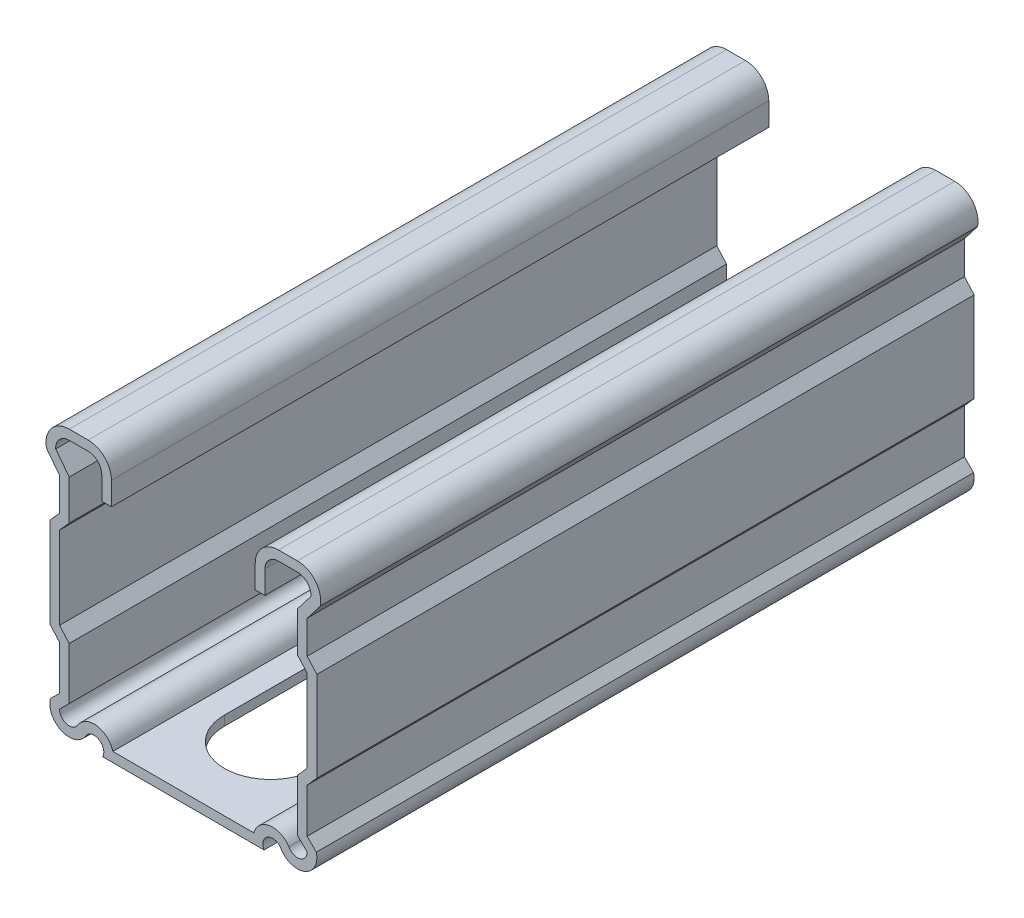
from build123d import *

# Parameters (mm, degrees)
BASE_EXTRUDE_DEPTH = 101.6
SLOT_DEPTH         = 127.877735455
LPATTERN1_COUNT    = 2
LPATTERN1_PITCH    = 50.8


with BuildPart() as part:
    # Sketch1 → Base-Extrude (new body)
    with BuildSketch(Plane.XY):
        with BuildLine():
            Line((17.6403, 16.339286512), (19.729882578, 19.063533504))
            ThreePointArc((19.729882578, 19.063533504), (19.156045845, 20.609744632), (17.6403, 21.2598))
            Line((17.6403, 21.2598), (14.70327367, 21.2598))
            ThreePointArc((14.70327367, 21.2598), (13.223883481, 20.647016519), (12.6111, 19.16762633))
            Line((12.6111, 19.16762633), (12.6111, 15.61465))
            Line((12.6111, 15.61465), (11.1125, 15.61465))
            Line((11.1125, 15.61465), (11.1125, 19.16762633))
            ThreePointArc((11.1125, 19.16762633), (12.164213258, 21.706686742), (14.70327367, 22.7584))
            Line((14.70327367, 22.7584), (17.6403, 22.7584))
            ThreePointArc((17.6403, 22.7584), (20.415434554, 21.446284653), (21.162428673, 18.4688666))
            Line((21.162428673, 18.4688666), (19.1389, 15.830735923))
            Line((19.1389, 15.830735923), (19.1389, 10.749129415))
            Line((19.1389, 10.749129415), (20.6375, 9.0662125))
            Line((20.6375, 9.0662125), (20.6375, -4.8244125))
            Line((20.6375, -4.8244125), (19.1389, -6.507329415))
            Line((19.1389, -6.507329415), (19.1389, -13.358784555))
            Line((19.1389, -13.358784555), (20.553458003, -14.773342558))
            ThreePointArc((20.553458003, -14.773342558), (18.729942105, -18.270236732), (15.019825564, -16.932883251))
            ThreePointArc((15.019825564, -16.932883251), (13.000752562, -16.523120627), (12.480559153, -18.5166))
            Line((12.480559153, -18.5166), (-12.480559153, -18.5166))
            ThreePointArc((-12.480559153, -18.5166), (-13.000752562, -16.523120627), (-15.019825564, -16.932883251))
            ThreePointArc((-15.019825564, -16.932883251), (-18.729942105, -18.270236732), (-20.553458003, -14.773342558))
            Line((-20.553458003, -14.773342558), (-19.1389, -13.358784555))
            Line((-19.1389, -13.358784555), (-19.1389, -6.507329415))
            Line((-19.1389, -6.507329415), (-20.6375, -4.8244125))
            Line((-20.6375, -4.8244125), (-20.6375, 9.0662125))
            Line((-20.6375, 9.0662125), (-19.1389, 10.749129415))
            Line((-19.1389, 10.749129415), (-19.1389, 15.830735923))
            Line((-19.1389, 15.830735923), (-21.162428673, 18.4688666))
            ThreePointArc((-21.162428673, 18.4688666), (-20.415434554, 21.446284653), (-17.6403, 22.7584))
            Line((-17.6403, 22.7584), (-14.70327367, 22.7584))
            ThreePointArc((-14.70327367, 22.7584), (-12.164213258, 21.706686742), (-11.1125, 19.16762633))
            Line((-11.1125, 19.16762633), (-11.1125, 15.61465))
            Line((-11.1125, 15.61465), (-12.6111, 15.61465))
            Line((-12.6111, 15.61465), (-12.6111, 19.16762633))
            ThreePointArc((-12.6111, 19.16762633), (-13.223883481, 20.647016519), (-14.70327367, 21.2598))
            Line((-14.70327367, 21.2598), (-17.6403, 21.2598))
            ThreePointArc((-17.6403, 21.2598), (-19.156045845, 20.609744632), (-19.729882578, 19.063533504))
            Line((-19.729882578, 19.063533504), (-17.6403, 16.339286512))
            Line((-17.6403, 16.339286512), (-17.6403, 10.17860201))
            Line((-17.6403, 10.17860201), (-19.1389, 8.495685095))
            Line((-19.1389, 8.495685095), (-19.1389, -4.253885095))
            Line((-19.1389, -4.253885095), (-17.6403, -5.93680201))
            Line((-17.6403, -5.93680201), (-17.6403, -13.979525))
            Line((-17.6403, -13.979525), (-19.1389, -15.478125))
            ThreePointArc((-19.1389, -15.478125), (-18.092238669, -16.906954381), (-16.414285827, -16.33992034))
            ThreePointArc((-16.414285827, -16.33992034), (-13.428073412, -14.819877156), (-10.898992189, -17.018))
            Line((-10.898992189, -17.018), (10.898992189, -17.018))
            ThreePointArc((10.898992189, -17.018), (13.323359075, -14.834630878), (16.30518861, -16.15877141))
            ThreePointArc((16.30518861, -16.15877141), (17.990302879, -16.935279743), (19.1389, -15.478125))
            Line((19.1389, -15.478125), (17.6403, -13.979525))
            Line((17.6403, -13.979525), (17.6403, -5.93680201))
            Line((17.6403, -5.93680201), (19.1389, -4.253885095))
            Line((19.1389, -4.253885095), (19.1389, 8.495685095))
            Line((19.1389, 8.495685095), (17.6403, 10.17860201))
            Line((17.6403, 10.17860201), (17.6403, 16.339286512))
        make_face()
    extrude(amount=BASE_EXTRUDE_DEPTH)

    # Sketch2 → Slot (cut, through all)
    with BuildSketch(Plane(origin=(-0.093451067, -18.5166, -16.466077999), x_dir=(1, 0, 0), z_dir=(0, -1, 0))):
        with BuildLine():
            Line((7.237201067, 53.772327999), (7.237201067, 39.484827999))
            ThreePointArc((7.237201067, 39.484827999), (0.093451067, 32.341077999), (-7.050298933, 39.484827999))
            Line((-7.050298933, 39.484827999), (-7.050298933, 53.772327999))
            ThreePointArc((-7.050298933, 53.772327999), (0.093451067, 60.916077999), (7.237201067, 53.772327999))
        make_face()
    slot = extrude(amount=-SLOT_DEPTH, mode=Mode.SUBTRACT)

    # LPattern1: Slot ×2
    with Locations(*[(0, 0, i * LPATTERN1_PITCH) for i in range(1, LPATTERN1_COUNT)]):
        add(slot, mode=Mode.SUBTRACT)


solid = part.part
